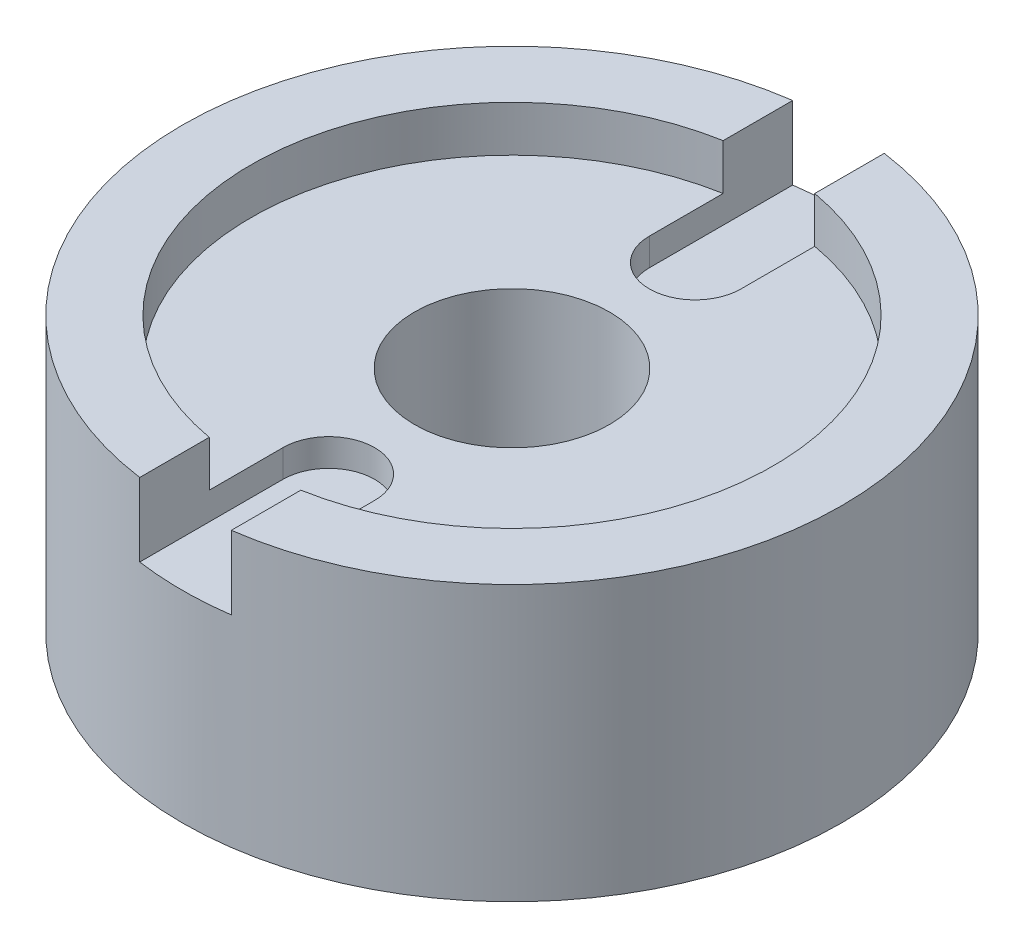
from build123d import *

# Parameters (mm, degrees)
SKETCH1_R               = 9.144
EXTRUDE1_DEPTH          = 7.62
SKETCH2_R               = 7.239
CUT_EXTRUDE1_DEPTH      = 1.27
F_1_4_28_TAPPED_HOLE1_D = 5.4102
CUT_EXTRUDE2_DEPTH      = 2.032


with BuildPart() as part:
    # Sketch1 → Extrude1 (new body)
    with BuildSketch(Plane(origin=(0, 0, 0), x_dir=(1, 0, 0), z_dir=(0, 1, 0))):
        with Locations(Location((0, 0, 0), (0, 0, 90))):
            Circle(SKETCH1_R)
    extrude(amount=EXTRUDE1_DEPTH)

    # Sketch2 → Cut-Extrude1 (cut)
    with BuildSketch(Plane(origin=(0, 7.62, 0), x_dir=(-1, 0, 0), z_dir=(0, 1, 0))):
        with Locations(Location((0, 0, 0), (0, 0, 90))):
            Circle(SKETCH2_R)
    extrude(amount=-CUT_EXTRUDE1_DEPTH, mode=Mode.SUBTRACT)

    # 1_4-28 Tapped Hole1 (through all)
    with Locations(Plane.XZ):
        with Locations((0, 0)):
            Hole(F_1_4_28_TAPPED_HOLE1_D / 2)

    # Sketch5 → Cut-Extrude2 (cut)
    with BuildSketch(Plane(origin=(0, 7.62, 0), x_dir=(-1, 0, 0), z_dir=(0, 1, 0))):
        with BuildLine():
            Line((-1.27, 5.08), (-1.27, 10.276930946))
            Line((-1.27, 10.276930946), (1.27, 10.276930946))
            Line((1.27, 10.276930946), (1.27, 5.08))
            ThreePointArc((1.27, 5.08), (0, 3.81), (-1.27, 5.08))
        make_face()
    cut_extrude2 = extrude(amount=-CUT_EXTRUDE2_DEPTH, mode=Mode.SUBTRACT)

    # Mirror1: Cut-Extrude2 across plane
    add(cut_extrude2.mirror(Plane.XY), mode=Mode.SUBTRACT)


solid = part.part
